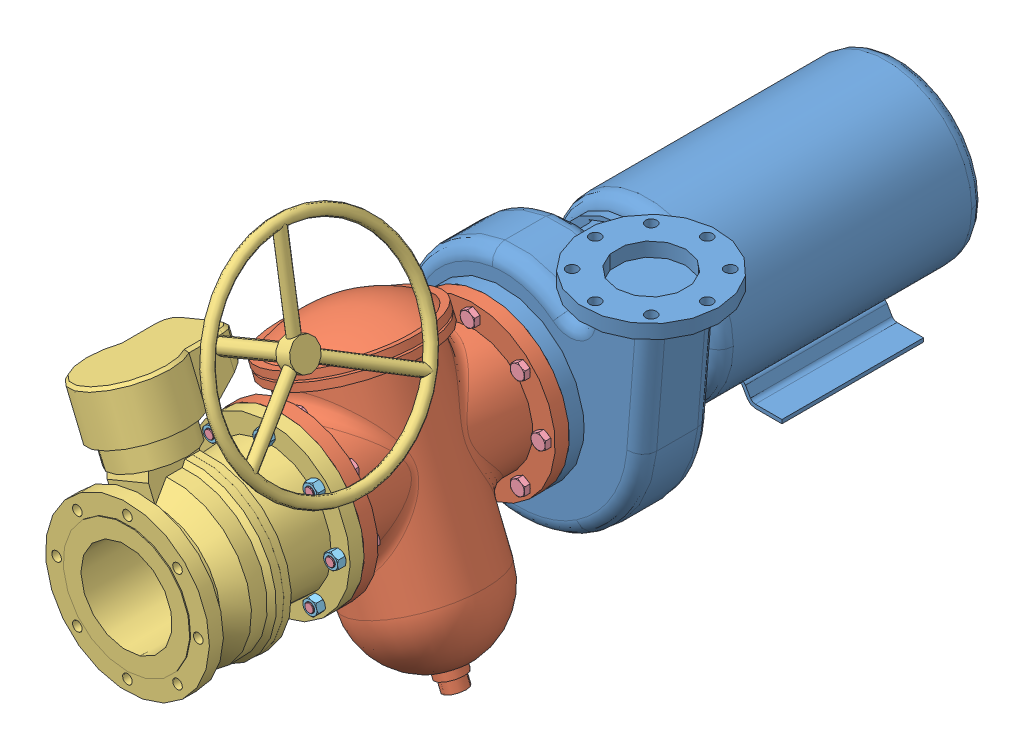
SolidWorks assembly Pump_Strainer_Valve.SLDASM, configuration Default (file format 13000). Lengths in mm.
Overall size (587.63 844.65 1319.21).
27 component instances, 5 part files, 27 mates.
Components (placement in the parent):
- PUMP-1: PUMP.SLDPRT [Default] at origin size (506.42 481.34 717.55)
- strainer-1: strainer.sldprt [Default] at (0 0 276.225) x (0 0 -1) z (0.92388 0.382683 0) size (352.43 514.41 279.4)
- Valve_w_handwheel-1: Valve_w_handwheel.sldprt [Default] at (0 0 715.9625) x (0 0 -1) z (0.92388 0.382683 0) size (387.36 574.68 390.53)
- Hex Finished Bolt_AI-1: Hex Finished Bolt_AI.SLDPRT [HFBOLT 0.625-18x2.5x1.5-N] at (85.3124 85.3124 416.8013) x (0 0 1) z (-1 0 0) size (73.74 27.51 23.83)
- Hex Nut_AI-1: Hex Nut_AI.SLDPRT [HNUT 0.6250-18-D-N] at (85.3124 85.3124 474.6625) x (-0.673646 -0.739054 0) z (0 0 -1) size (23.83 27.51 14.2)
- Hex Finished Bolt_AI-3: Hex Finished Bolt_AI.SLDPRT [HFBOLT 0.625-18x2.5x1.5-N] at (120.65 0 416.8013) x (0 0 1) z (-0.707107 0.707107 0) size (73.74 27.51 23.83)
- Hex Finished Bolt_AI-4: Hex Finished Bolt_AI.SLDPRT [HFBOLT 0.625-18x2.5x1.5-N] at (85.3124 -85.3124 416.8013) x (0 0 1) z (0 1 0) size (73.74 27.51 23.83)
- Hex Finished Bolt_AI-5: Hex Finished Bolt_AI.SLDPRT [HFBOLT 0.625-18x2.5x1.5-N] at (0 -120.65 416.8013) x (0 0 1) z (0.707107 0.707107 0) size (73.74 27.51 23.83)
- Hex Finished Bolt_AI-6: Hex Finished Bolt_AI.SLDPRT [HFBOLT 0.625-18x2.5x1.5-N] at (-85.3124 -85.3124 416.8013) x (0 0 1) z (1 0 0) size (73.74 27.51 23.83)
- Hex Finished Bolt_AI-7: Hex Finished Bolt_AI.SLDPRT [HFBOLT 0.625-18x2.5x1.5-N] at (-120.65 0 416.8013) x (0 0 1) z (0.707107 -0.707107 0) size (73.74 27.51 23.83)
- Hex Finished Bolt_AI-8: Hex Finished Bolt_AI.SLDPRT [HFBOLT 0.625-18x2.5x1.5-N] at (-85.3124 85.3124 416.8013) x (0 0 1) z (0 -1 0) size (73.74 27.51 23.83)
- Hex Finished Bolt_AI-9: Hex Finished Bolt_AI.SLDPRT [HFBOLT 0.625-18x2.5x1.5-N] at (0 120.65 416.8013) x (0 0 1) z (-0.707107 -0.707107 0) size (73.74 27.51 23.83)
- Hex Nut_AI-2: Hex Nut_AI.SLDPRT [HNUT 0.6250-18-D-N] at (120.65 0 474.6625) x (-0.99893 -0.04625 0) z (0 0 -1) size (23.83 27.51 14.2)
- Hex Nut_AI-3: Hex Nut_AI.SLDPRT [HNUT 0.6250-18-D-N] at (85.3124 -85.3124 474.6625) x (-0.739054 0.673646 0) z (0 0 -1) size (23.83 27.51 14.2)
- Hex Nut_AI-4: Hex Nut_AI.SLDPRT [HNUT 0.6250-18-D-N] at (0 -120.65 474.6625) x (-0.04625 0.99893 0) z (0 0 -1) size (23.83 27.51 14.2)
- Hex Nut_AI-5: Hex Nut_AI.SLDPRT [HNUT 0.6250-18-D-N] at (-85.3124 -85.3124 474.6625) x (0.673646 0.739054 0) z (0 0 -1) size (23.83 27.51 14.2)
- Hex Nut_AI-6: Hex Nut_AI.SLDPRT [HNUT 0.6250-18-D-N] at (-120.65 0 474.6625) x (0.99893 0.04625 0) z (0 0 -1) size (23.83 27.51 14.2)
- Hex Nut_AI-7: Hex Nut_AI.SLDPRT [HNUT 0.6250-18-D-N] at (-85.3124 85.3124 474.6625) x (0.739054 -0.673646 0) z (0 0 -1) size (23.83 27.51 14.2)
- Hex Nut_AI-8: Hex Nut_AI.SLDPRT [HNUT 0.6250-18-D-N] at (0 120.65 474.6625) x (0.04625 -0.99893 0) z (0 0 -1) size (23.83 27.51 14.2)
- Hex Finished Bolt_AI-10: Hex Finished Bolt_AI.SLDPRT [HFBOLT 0.625-18x1x1-N] at (85.3124 85.3124 135.6487) x (0 0 -1) z (1 0 0) size (35.64 27.51 23.83)
- Hex Finished Bolt_AI-12: Hex Finished Bolt_AI.SLDPRT [HFBOLT 0.625-11x1x1-N] at (0 120.65 135.6487) x (0 0 -1) z (1 0 0) size (35.64 27.51 23.83)
- Hex Finished Bolt_AI-13: Hex Finished Bolt_AI.SLDPRT [HFBOLT 0.625-11x1x1-N] at (120.65 0 135.6487) x (0 0 -1) z (1 0 0) size (35.64 27.51 23.83)
- Hex Finished Bolt_AI-14: Hex Finished Bolt_AI.SLDPRT [HFBOLT 0.625-11x1x1-N] at (85.3124 -85.3124 135.6487) x (0 0 -1) z (1 0 0) size (35.64 27.51 23.83)
- Hex Finished Bolt_AI-15: Hex Finished Bolt_AI.SLDPRT [HFBOLT 0.625-11x1x1-N] at (-85.3124 85.3124 135.6487) x (0 0 -1) z (1 0 0) size (35.64 27.51 23.83)
- Hex Finished Bolt_AI-16: Hex Finished Bolt_AI.SLDPRT [HFBOLT 0.625-11x1x1-N] at (-120.65 0 135.6487) x (0 0 -1) z (1 0 0) size (35.64 27.51 23.83)
- Hex Finished Bolt_AI-17: Hex Finished Bolt_AI.SLDPRT [HFBOLT 0.625-11x1x1-N] at (-85.3124 -85.3124 135.6487) x (0 0 -1) z (1 0 0) size (35.64 27.51 23.83)
- Hex Finished Bolt_AI-18: Hex Finished Bolt_AI.SLDPRT [HFBOLT 0.625-11x1x1-N] at (0 -120.65 135.6487) x (0 0 -1) z (1 0 0) size (35.64 27.51 23.83)
Mates (geometry in assembly coordinates):
- Concentric1: concentric anti-aligned: cylinder of PUMP-1 through (0 0 -181.0643) axis (0 0 1) radius 85.344; cylinder of strainer-1 through (0 0 215.7206) axis (0 0 -1) radius 77.089
- Coincident1: coincident anti-aligned: plane of PUMP-1 through (0 0 101.6) normal (0 0 1); plane of strainer-1 through (0 0 101.6) normal (0 0 -1)
- Concentric3: concentric anti-aligned: cylinder of PUMP-1 through (85.3124 85.3124 76.2) axis (0 0 1) radius 11.176; cylinder of strainer-1 through (85.3124 85.3124 101.6) axis (0 0 -1) radius 9.9212
- Concentric4: concentric aligned: cylinder of Valve_w_handwheel-1 through (0 0 715.9625) axis (0 0 -1) radius 77.7875; cylinder of strainer-1 through (0 0 452.4375) axis (0 0 -1) radius 77.089
- Concentric5: concentric anti-aligned: cylinder of strainer-1 through (85.3124 85.3124 450.85) axis (0 0 1) radius 9.9212; cylinder of Valve_w_handwheel-1 through (85.3124 85.3124 450.85) axis (0 0 -1) radius 8.3337
- Coincident3: coincident anti-aligned: plane of strainer-1 through (0 0 450.85) normal (0 0 1); plane of Valve_w_handwheel-1 through (0 0 450.85) normal (0 0 -1)
- Concentric7: concentric anti-aligned: cylinder of strainer-1 through (85.3124 85.3124 450.85) axis (0 0 1) radius 9.9212; cylinder of Hex Finished Bolt_AI-1 through (85.3124 85.3124 416.8013) axis (0 0 -1) radius 7.9375
- Coincident4: coincident anti-aligned: plane of strainer-1 through (0 0 427.0375) normal (0 0 -1); plane of Hex Finished Bolt_AI-1 through (85.3124 99.0679 427.0375) normal (0 0 1)
- Concentric12: concentric aligned: cylinder of Hex Finished Bolt_AI-1 through (85.3124 85.3124 416.8013) axis (0 0 -1) radius 7.9375; cylinder of Hex Nut_AI-1 through (85.3124 85.3124 499.7) axis (0 0 -1) radius 7.9375
- Concentric111: concentric aligned: cylinder of Hex Finished Bolt_AI-1 through (85.3124 85.3124 416.8013) axis (0 0 -1) radius 7.9375; cylinder of Hex Nut_AI-1 through (85.3124 85.3124 499.7) axis (0 0 -1) radius 7.9375
- Coincident7: coincident anti-aligned: plane of Valve_w_handwheel-1 through (0 0 474.6625) normal (0 0 1); plane of Hex Nut_AI-1 through (75.1464 94.5788 474.6625) normal (0 0 -1)
- Concentric13: concentric anti-aligned: cylinder of strainer-1 through (85.3124 85.3124 101.6) axis (0 0 -1) radius 9.9212; cylinder of Hex Finished Bolt_AI-10 through (85.3124 85.3124 135.6487) axis (0 0 1) radius 7.9375
- Coincident8: coincident anti-aligned: plane of strainer-1 through (0 0 125.4125) normal (0 0 1); plane of Hex Finished Bolt_AI-10 through (85.3124 99.0679 125.4125) normal (0 0 -1)
- Concentric15: concentric anti-aligned: cylinder of strainer-1 through (0 120.65 101.6) axis (0 0 -1) radius 9.9212; cylinder of Hex Finished Bolt_AI-12 through (0 120.65 135.6487) axis (0 0 1) radius 7.9375
- Coincident10: coincident anti-aligned: plane of strainer-1 through (0 0 125.4125) normal (0 0 1); plane of Hex Finished Bolt_AI-12 through (0 134.4055 125.4125) normal (0 0 -1)
- Concentric16: concentric anti-aligned: cylinder of strainer-1 through (120.65 0 101.6) axis (0 0 -1) radius 9.9212; cylinder of Hex Finished Bolt_AI-13 through (120.65 0 135.6487) axis (0 0 1) radius 11.9126
- Coincident11: coincident anti-aligned: plane of strainer-1 through (0 0 125.4125) normal (0 0 1); plane of Hex Finished Bolt_AI-13 through (120.65 13.7555 125.4125) normal (0 0 -1)
- Concentric17: concentric anti-aligned: cylinder of strainer-1 through (85.3124 -85.3124 101.6) axis (0 0 -1) radius 9.9212; cylinder of Hex Finished Bolt_AI-14 through (85.3124 -85.3124 135.6487) axis (0 0 1) radius 11.9126
- Coincident12: coincident anti-aligned: plane of strainer-1 through (0 0 125.4125) normal (0 0 1); plane of Hex Finished Bolt_AI-14 through (85.3124 -71.5569 125.4125) normal (0 0 -1)
- Concentric18: concentric anti-aligned: cylinder of strainer-1 through (-85.3124 85.3124 101.6) axis (0 0 -1) radius 9.9212; cylinder of Hex Finished Bolt_AI-15 through (-85.3124 85.3124 135.6487) axis (0 0 1) radius 11.9126
- Coincident13: coincident anti-aligned: plane of strainer-1 through (0 0 125.4125) normal (0 0 1); plane of Hex Finished Bolt_AI-15 through (-85.3124 99.0679 125.4125) normal (0 0 -1)
- Concentric19: concentric anti-aligned: cylinder of strainer-1 through (-120.65 0 101.6) axis (0 0 -1) radius 9.9212; cylinder of Hex Finished Bolt_AI-16 through (-120.65 0 135.6487) axis (0 0 1) radius 11.9126
- Coincident14: coincident anti-aligned: plane of strainer-1 through (0 0 125.4125) normal (0 0 1); plane of Hex Finished Bolt_AI-16 through (-120.65 13.7555 125.4125) normal (0 0 -1)
- Concentric20: concentric anti-aligned: cylinder of strainer-1 through (-85.3124 -85.3124 101.6) axis (0 0 -1) radius 9.9212; cylinder of Hex Finished Bolt_AI-17 through (-85.3124 -85.3124 135.6487) axis (0 0 1) radius 11.9126
- Coincident15: coincident anti-aligned: plane of strainer-1 through (0 0 125.4125) normal (0 0 1); plane of Hex Finished Bolt_AI-17 through (-85.3124 -71.5569 125.4125) normal (0 0 -1)
- Concentric21: concentric anti-aligned: cylinder of strainer-1 through (0 -120.65 101.6) axis (0 0 -1) radius 9.9212; cylinder of Hex Finished Bolt_AI-18 through (0 -120.65 135.6487) axis (0 0 1) radius 11.9126
- Coincident16: coincident anti-aligned: plane of strainer-1 through (0 0 125.4125) normal (0 0 1); plane of Hex Finished Bolt_AI-18 through (0 -106.8945 125.4125) normal (0 0 -1)
